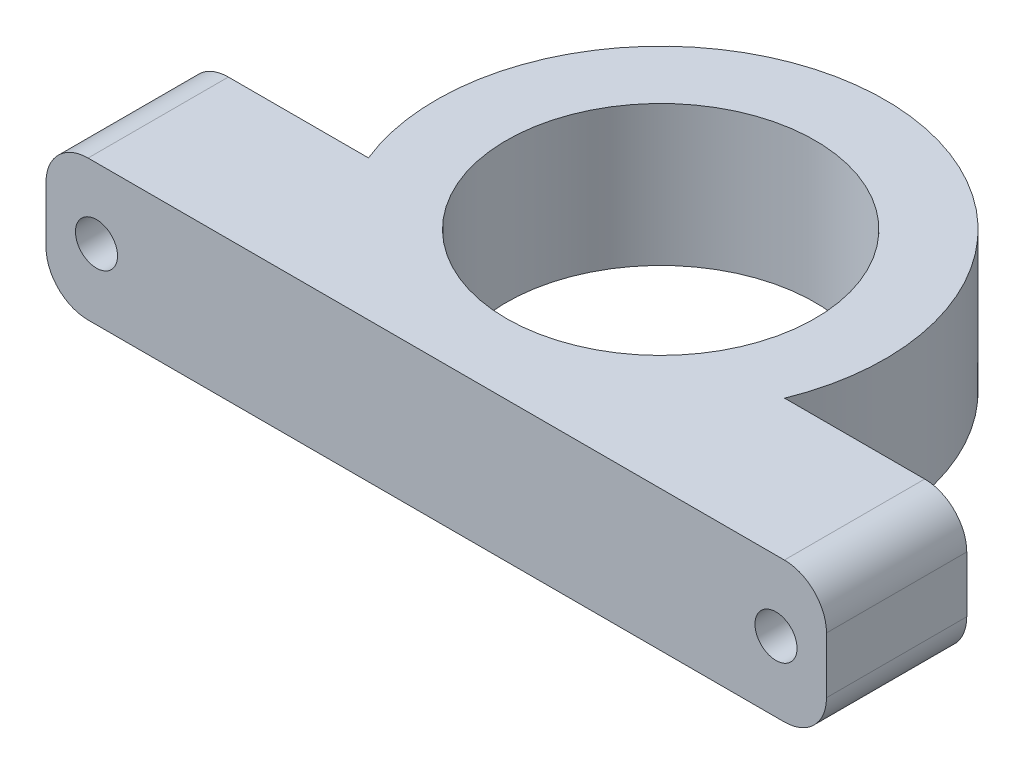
from build123d import *

# Parameters (mm, degrees)
SKETCH1_R           = 16
SKETCH1_R_2         = 11
BOSS_EXTRUDE1_DEPTH = 10
SKETCH2_R           = 1.5
CUT_EXTRUDE1_DEPTH  = 37.849295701
FILLET1_R           = 3


with BuildPart() as part:
    # Sketch1 → Boss-Extrude1 (new body)
    # profile 1 of 3: a face of its own
    with BuildSketch(Plane(origin=(0, 0, 0), x_dir=(1, 0, 0), z_dir=(0, 1, 0))):
        Circle(SKETCH1_R)
        with Locations(Location((0, 0, 0), (0, 0, 270))):
            Circle(SKETCH1_R_2, mode=Mode.SUBTRACT)
    # profile 2 of 3: a face of its own
    with BuildSketch(Plane(origin=(0, 0, 0), x_dir=(1, 0, 0), z_dir=(0, 1, 0))):
        with BuildLine():
            Line((-27.818529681, -6), (-27.818529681, -16))
            Line((-27.818529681, -16), (0, -16))
            ThreePointArc((0, -16), (-8.94427191, -13.266499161), (-14.832396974, -6))
            Line((-14.832396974, -6), (-27.818529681, -6))
        make_face()
    # profile 3 of 3: a face of its own
    with BuildSketch(Plane(origin=(0, 0, 0), x_dir=(1, 0, 0), z_dir=(0, 1, 0))):
        with BuildLine():
            ThreePointArc((14.832396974, -6), (8.94427191, -13.266499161), (0, -16))
            Line((0, -16), (27.818529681, -16))
            Line((27.818529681, -16), (27.818529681, -6))
            Line((27.818529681, -6), (14.832396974, -6))
        make_face()
    extrude(amount=BOSS_EXTRUDE1_DEPTH)

    # Sketch2 → Cut-Extrude1 (cut, through all)
    with BuildSketch(Plane(origin=(0, 0, 6), x_dir=(-1, 0, 0), z_dir=(0, 0, -1))):
        with Locations((-24.218529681, 5)):
            Circle(SKETCH2_R)
        with Locations((24.218529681, 5)):
            Circle(SKETCH2_R)
    extrude(amount=-CUT_EXTRUDE1_DEPTH, mode=Mode.SUBTRACT)

    # Fillet1
    fillet1_edges = [part.edges().sort_by_distance(p)[0] for p in [
        (-27.818529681, 10, 11),
        (27.818529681, 10, 11),
        (27.818529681, 0, 11),
        (-27.818529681, 0, 11),
    ]]
    fillet(fillet1_edges, radius=FILLET1_R)


solid = part.part
